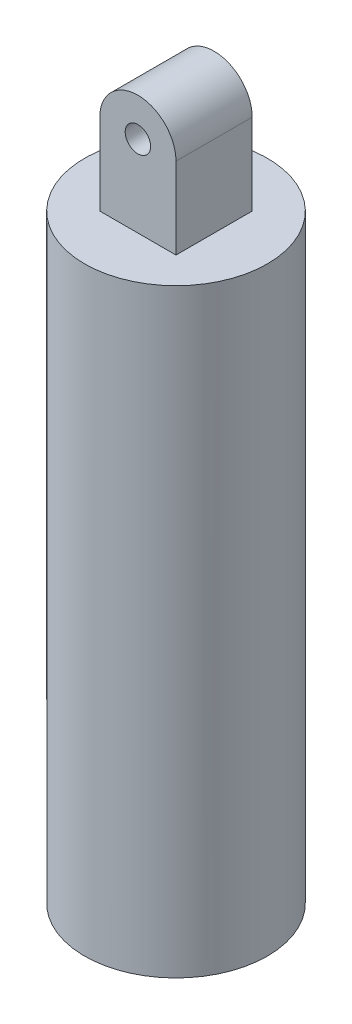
from build123d import *

# Parameters (mm, degrees)
SKETCH1_R           = 18
SKETCH1_R_2         = 15
EXTRUDE_THIN1_DEPTH = 115
SKETCH2_R           = 18
BOSS_EXTRUDE1_DEPTH = 3
SKETCH3_R           = 2.5
BOSS_EXTRUDE2_DEPTH = 7.5


with BuildPart() as part:
    # Sketch1 → Extrude-Thin1 (new body)
    with BuildSketch(Plane(origin=(0, 0, 0), x_dir=(1, 0, 0), z_dir=(0, 1, 0))):
        Circle(SKETCH1_R)
        Circle(SKETCH1_R_2, mode=Mode.SUBTRACT)
    extrude(amount=EXTRUDE_THIN1_DEPTH)

    # Sketch2 → Boss-Extrude1 (add)
    with BuildSketch(Plane(origin=(0, 115, 0), x_dir=(1, 0, 0), z_dir=(0, 1, 0))):
        Circle(SKETCH2_R)
    extrude(amount=BOSS_EXTRUDE1_DEPTH)

    # Sketch3 → Boss-Extrude2 (add, symmetric)
    with BuildSketch(Plane.XY):
        with BuildLine():
            Line((-7.5, 118), (-7.5, 134))
            ThreePointArc((-7.5, 134), (0, 141.5), (7.5, 134))
            Line((7.5, 134), (7.5, 118))
            Line((7.5, 118), (-7.5, 118))
        make_face()
        with Locations((0, 134)):
            Circle(SKETCH3_R, mode=Mode.SUBTRACT)
    extrude(amount=BOSS_EXTRUDE2_DEPTH, both=True)


solid = part.part
